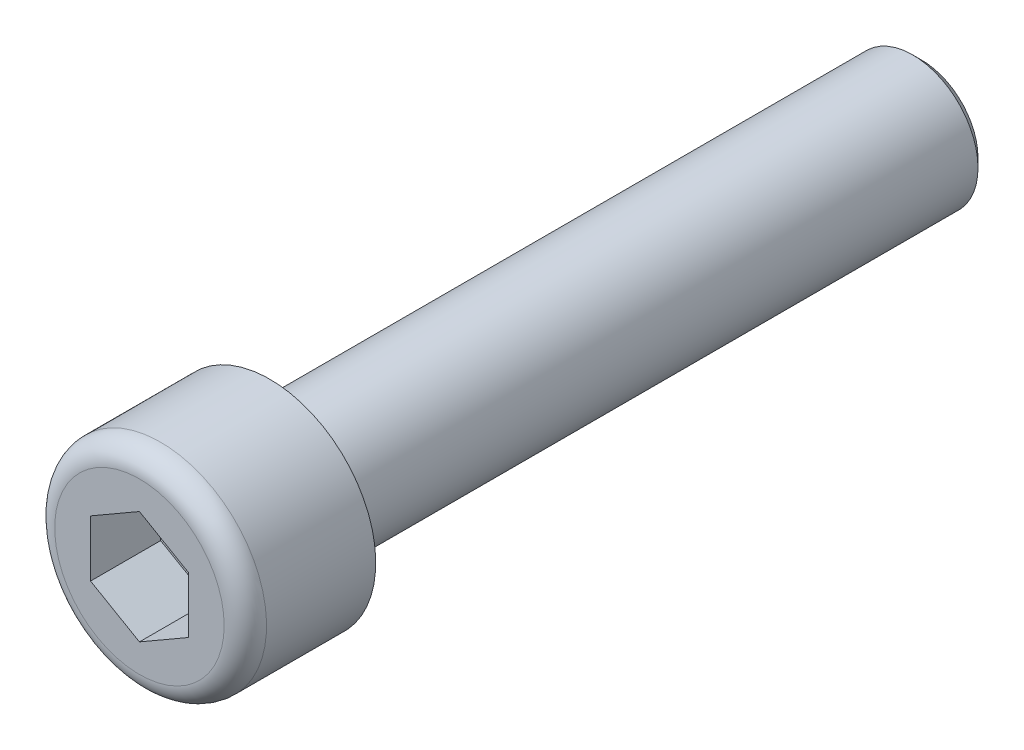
ISO-10303-21;
HEADER;
FILE_DESCRIPTION(('STEP AP214'),'2;1');
FILE_NAME('part.step','',(''),(''),'','','');
FILE_SCHEMA(('AUTOMOTIVE_DESIGN { 1 0 10303 214 1 1 1 1 }'));
ENDSEC;
DATA;
#1=APPLICATION_CONTEXT('core data for automotive mechanical design processes');
#2=APPLICATION_PROTOCOL_DEFINITION('international standard','automotive_design',2000,#1);
#3=PRODUCT_CONTEXT('',#1,'mechanical');
#4=PRODUCT('Part','Part','',(#3));
#5=PRODUCT_RELATED_PRODUCT_CATEGORY('part','',(#4));
#6=PRODUCT_DEFINITION_FORMATION('','',#4);
#7=PRODUCT_DEFINITION_CONTEXT('part definition',#1,'design');
#8=PRODUCT_DEFINITION('design','',#6,#7);
#9=PRODUCT_DEFINITION_SHAPE('','',#8);
#10=(LENGTH_UNIT() NAMED_UNIT(*) SI_UNIT(.MILLI.,.METRE.));
#11=(NAMED_UNIT(*) PLANE_ANGLE_UNIT() SI_UNIT($,.RADIAN.));
#12=(NAMED_UNIT(*) SI_UNIT($,.STERADIAN.) SOLID_ANGLE_UNIT());
#13=UNCERTAINTY_MEASURE_WITH_UNIT(LENGTH_MEASURE(1.E-05),#10,'distance_accuracy_value','');
#14=(GEOMETRIC_REPRESENTATION_CONTEXT(3) GLOBAL_UNCERTAINTY_ASSIGNED_CONTEXT((#13)) GLOBAL_UNIT_ASSIGNED_CONTEXT((#10,
#11,#12)) REPRESENTATION_CONTEXT('',''));
#15=CARTESIAN_POINT('',(0.,0.,0.));
#16=DIRECTION('',(0.,0.,1.));
#17=DIRECTION('',(1.,0.,0.));
#18=AXIS2_PLACEMENT_3D('',#15,#16,#17);
#19=CARTESIAN_POINT('',(0.,0.,0.));
#20=DIRECTION('',(0.,0.,1.));
#21=DIRECTION('',(-0.500000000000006,-0.866025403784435,0.));
#22=AXIS2_PLACEMENT_3D('',#19,#20,#21);
#23=PLANE('',#22);
#24=CARTESIAN_POINT('',(0.,0.,0.));
#25=DIRECTION('',(0.,0.,1.));
#26=DIRECTION('',(-0.500000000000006,-0.866025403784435,0.));
#27=AXIS2_PLACEMENT_3D('',#24,#25,#26);
#28=CIRCLE('',#27,6.5);
#29=CARTESIAN_POINT('',(-3.25000000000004,-5.62916512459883,0.));
#30=VERTEX_POINT('',#29);
#31=EDGE_CURVE('E107',#30,#30,#28,.T.);
#32=ORIENTED_EDGE('',*,*,#31,.F.);
#33=EDGE_LOOP('',(#32));
#34=FACE_BOUND('',#33,.T.);
#35=CARTESIAN_POINT('',(0.,0.,0.));
#36=DIRECTION('',(0.,0.,1.));
#37=DIRECTION('',(-0.500000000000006,-0.866025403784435,0.));
#38=AXIS2_PLACEMENT_3D('',#35,#36,#37);
#39=CIRCLE('',#38,4.);
#40=CARTESIAN_POINT('',(-2.00000000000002,-3.46410161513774,0.));
#41=VERTEX_POINT('',#40);
#42=EDGE_CURVE('E9',#41,#41,#39,.F.);
#43=ORIENTED_EDGE('',*,*,#42,.F.);
#44=EDGE_LOOP('',(#43));
#45=FACE_BOUND('',#44,.T.);
#46=ADVANCED_FACE('F14',(#34,#45),#23,.F.);
#47=CARTESIAN_POINT('',(4.50333209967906,-2.60000000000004,8.));
#48=DIRECTION('',(0.,0.,-1.));
#49=DIRECTION('',(0.500000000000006,0.866025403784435,0.));
#50=AXIS2_PLACEMENT_3D('',#47,#48,#49);
#51=PLANE('',#50);
#52=CARTESIAN_POINT('',(0.,0.,8.));
#53=DIRECTION('',(0.,0.,1.));
#54=DIRECTION('',(-0.500000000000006,-0.866025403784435,0.));
#55=AXIS2_PLACEMENT_3D('',#52,#53,#54);
#56=CIRCLE('',#55,5.2);
#57=CARTESIAN_POINT('',(-2.60000000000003,-4.50333209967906,8.));
#58=VERTEX_POINT('',#57);
#59=EDGE_CURVE('E89',#58,#58,#56,.T.);
#60=ORIENTED_EDGE('',*,*,#59,.T.);
#61=EDGE_LOOP('',(#60));
#62=FACE_BOUND('',#61,.T.);
#63=DIRECTION('',(0.866025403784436,-0.5,0.));
#64=VECTOR('',#63,1.);
#65=CARTESIAN_POINT('',(3.00333209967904,-5.19807621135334,8.));
#66=LINE('',#65,#64);
#67=CARTESIAN_POINT('',(-3.,-1.73205080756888,8.));
#68=VERTEX_POINT('',#67);
#69=CARTESIAN_POINT('',(0.,-3.46410161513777,8.));
#70=VERTEX_POINT('',#69);
#71=EDGE_CURVE('E23',#68,#70,#66,.T.);
#72=ORIENTED_EDGE('',*,*,#71,.F.);
#73=DIRECTION('',(0.,-1.,0.));
#74=VECTOR('',#73,1.);
#75=CARTESIAN_POINT('',(-3.,-2.6,8.));
#76=LINE('',#75,#74);
#77=CARTESIAN_POINT('',(-3.,1.73205080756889,8.));
#78=VERTEX_POINT('',#77);
#79=EDGE_CURVE('E38',#78,#68,#76,.T.);
#80=ORIENTED_EDGE('',*,*,#79,.F.);
#81=DIRECTION('',(-0.866025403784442,-0.5,0.));
#82=VECTOR('',#81,1.);
#83=CARTESIAN_POINT('',(0.751666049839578,3.89807621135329,8.));
#84=LINE('',#83,#82);
#85=CARTESIAN_POINT('',(0.,3.46410161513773,8.));
#86=VERTEX_POINT('',#85);
#87=EDGE_CURVE('E120',#86,#78,#84,.T.);
#88=ORIENTED_EDGE('',*,*,#87,.F.);
#89=DIRECTION('',(-0.866025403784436,0.5,0.));
#90=VECTOR('',#89,1.);
#91=CARTESIAN_POINT('',(6.00333209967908,-0.00192378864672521,8.));
#92=LINE('',#91,#90);
#93=CARTESIAN_POINT('',(3.,1.73205080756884,8.));
#94=VERTEX_POINT('',#93);
#95=EDGE_CURVE('E117',#94,#86,#92,.T.);
#96=ORIENTED_EDGE('',*,*,#95,.F.);
#97=DIRECTION('',(0.,1.,0.));
#98=VECTOR('',#97,1.);
#99=CARTESIAN_POINT('',(3.,-2.60000000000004,8.));
#100=LINE('',#99,#98);
#101=CARTESIAN_POINT('',(3.,-1.7320508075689,8.));
#102=VERTEX_POINT('',#101);
#103=EDGE_CURVE('E114',#102,#94,#100,.T.);
#104=ORIENTED_EDGE('',*,*,#103,.F.);
#105=DIRECTION('',(0.866025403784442,0.5,0.));
#106=VECTOR('',#105,1.);
#107=CARTESIAN_POINT('',(3.75166604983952,-1.29807621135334,8.));
#108=LINE('',#107,#106);
#109=EDGE_CURVE('E111',#70,#102,#108,.T.);
#110=ORIENTED_EDGE('',*,*,#109,.F.);
#111=EDGE_LOOP('',(#72,#80,#88,#96,#104,#110));
#112=FACE_BOUND('',#111,.T.);
#113=ADVANCED_FACE('F16',(#62,#112),#51,.F.);
#114=CARTESIAN_POINT('',(0.,0.,8.));
#115=DIRECTION('',(0.,0.,1.));
#116=DIRECTION('',(-0.500000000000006,-0.866025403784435,0.));
#117=AXIS2_PLACEMENT_3D('',#114,#115,#116);
#118=CYLINDRICAL_SURFACE('',#117,6.5);
#119=CARTESIAN_POINT('',(0.,0.,6.7));
#120=DIRECTION('',(0.,0.,1.));
#121=DIRECTION('',(-0.500000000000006,-0.866025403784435,0.));
#122=AXIS2_PLACEMENT_3D('',#119,#120,#121);
#123=CIRCLE('',#122,6.5);
#124=CARTESIAN_POINT('',(-3.25000000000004,-5.62916512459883,6.7));
#125=VERTEX_POINT('',#124);
#126=EDGE_CURVE('E97',#125,#125,#123,.T.);
#127=ORIENTED_EDGE('',*,*,#126,.F.);
#128=EDGE_LOOP('',(#127));
#129=FACE_BOUND('',#128,.T.);
#130=ORIENTED_EDGE('',*,*,#31,.T.);
#131=EDGE_LOOP('',(#130));
#132=FACE_BOUND('',#131,.T.);
#133=ADVANCED_FACE('F206',(#129,#132),#118,.T.);
#134=CARTESIAN_POINT('',(0.,0.,6.7));
#135=DIRECTION('',(0.,0.,1.));
#136=DIRECTION('',(-0.500000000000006,-0.866025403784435,0.));
#137=AXIS2_PLACEMENT_3D('',#134,#135,#136);
#138=TOROIDAL_SURFACE('',#137,5.2,1.3);
#139=ORIENTED_EDGE('',*,*,#59,.F.);
#140=EDGE_LOOP('',(#139));
#141=FACE_BOUND('',#140,.T.);
#142=ORIENTED_EDGE('',*,*,#126,.T.);
#143=EDGE_LOOP('',(#142));
#144=FACE_BOUND('',#143,.T.);
#145=ADVANCED_FACE('F213',(#141,#144),#138,.T.);
#146=CARTESIAN_POINT('',(0.,-3.46410161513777,3.7));
#147=DIRECTION('',(0.5,0.866025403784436,0.));
#148=DIRECTION('',(0.866025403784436,-0.5,0.));
#149=AXIS2_PLACEMENT_3D('',#146,#147,#148);
#150=PLANE('',#149);
#151=ORIENTED_EDGE('',*,*,#71,.T.);
#152=DIRECTION('',(0.,0.,1.));
#153=VECTOR('',#152,1.);
#154=CARTESIAN_POINT('',(0.,-3.46410161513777,3.7));
#155=LINE('',#154,#153);
#156=CARTESIAN_POINT('',(0.,-3.46410161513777,3.7));
#157=VERTEX_POINT('',#156);
#158=EDGE_CURVE('E30',#157,#70,#155,.T.);
#159=ORIENTED_EDGE('',*,*,#158,.F.);
#160=DIRECTION('',(-0.866025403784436,0.5,0.));
#161=VECTOR('',#160,1.);
#162=CARTESIAN_POINT('',(0.,-3.46410161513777,3.7));
#163=LINE('',#162,#161);
#164=CARTESIAN_POINT('',(-3.,-1.73205080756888,3.7));
#165=VERTEX_POINT('',#164);
#166=EDGE_CURVE('E74',#157,#165,#163,.T.);
#167=ORIENTED_EDGE('',*,*,#166,.T.);
#168=DIRECTION('',(0.,0.,1.));
#169=VECTOR('',#168,1.);
#170=CARTESIAN_POINT('',(-3.,-1.73205080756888,3.7));
#171=LINE('',#170,#169);
#172=EDGE_CURVE('E82',#165,#68,#171,.T.);
#173=ORIENTED_EDGE('',*,*,#172,.T.);
#174=EDGE_LOOP('',(#151,#159,#167,#173));
#175=FACE_BOUND('',#174,.T.);
#176=ADVANCED_FACE('F81',(#175),#150,.T.);
#177=CARTESIAN_POINT('',(-3.,-1.73205080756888,3.7));
#178=DIRECTION('',(1.,0.,0.));
#179=DIRECTION('',(0.,-1.,0.));
#180=AXIS2_PLACEMENT_3D('',#177,#178,#179);
#181=PLANE('',#180);
#182=ORIENTED_EDGE('',*,*,#79,.T.);
#183=ORIENTED_EDGE('',*,*,#172,.F.);
#184=DIRECTION('',(0.,1.,0.));
#185=VECTOR('',#184,1.);
#186=CARTESIAN_POINT('',(-3.,-1.73205080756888,3.7));
#187=LINE('',#186,#185);
#188=CARTESIAN_POINT('',(-3.,1.73205080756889,3.7));
#189=VERTEX_POINT('',#188);
#190=EDGE_CURVE('E70',#165,#189,#187,.T.);
#191=ORIENTED_EDGE('',*,*,#190,.T.);
#192=DIRECTION('',(0.,0.,1.));
#193=VECTOR('',#192,1.);
#194=CARTESIAN_POINT('',(-3.,1.73205080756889,3.7));
#195=LINE('',#194,#193);
#196=EDGE_CURVE('E90',#189,#78,#195,.T.);
#197=ORIENTED_EDGE('',*,*,#196,.T.);
#198=EDGE_LOOP('',(#182,#183,#191,#197));
#199=FACE_BOUND('',#198,.T.);
#200=ADVANCED_FACE('F87',(#199),#181,.T.);
#201=CARTESIAN_POINT('',(-3.,1.73205080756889,3.7));
#202=DIRECTION('',(0.5,-0.866025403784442,0.));
#203=DIRECTION('',(-0.866025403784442,-0.5,0.));
#204=AXIS2_PLACEMENT_3D('',#201,#202,#203);
#205=PLANE('',#204);
#206=ORIENTED_EDGE('',*,*,#87,.T.);
#207=ORIENTED_EDGE('',*,*,#196,.F.);
#208=DIRECTION('',(0.866025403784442,0.5,0.));
#209=VECTOR('',#208,1.);
#210=CARTESIAN_POINT('',(-3.,1.73205080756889,3.7));
#211=LINE('',#210,#209);
#212=CARTESIAN_POINT('',(0.,3.46410161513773,3.7));
#213=VERTEX_POINT('',#212);
#214=EDGE_CURVE('E76',#189,#213,#211,.T.);
#215=ORIENTED_EDGE('',*,*,#214,.T.);
#216=DIRECTION('',(0.,0.,1.));
#217=VECTOR('',#216,1.);
#218=CARTESIAN_POINT('',(0.,3.46410161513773,3.7));
#219=LINE('',#218,#217);
#220=EDGE_CURVE('E100',#213,#86,#219,.T.);
#221=ORIENTED_EDGE('',*,*,#220,.T.);
#222=EDGE_LOOP('',(#206,#207,#215,#221));
#223=FACE_BOUND('',#222,.T.);
#224=ADVANCED_FACE('F159',(#223),#205,.T.);
#225=CARTESIAN_POINT('',(0.,3.46410161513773,3.7));
#226=DIRECTION('',(-0.5,-0.866025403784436,0.));
#227=DIRECTION('',(-0.866025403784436,0.5,0.));
#228=AXIS2_PLACEMENT_3D('',#225,#226,#227);
#229=PLANE('',#228);
#230=ORIENTED_EDGE('',*,*,#95,.T.);
#231=ORIENTED_EDGE('',*,*,#220,.F.);
#232=DIRECTION('',(0.866025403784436,-0.5,0.));
#233=VECTOR('',#232,1.);
#234=CARTESIAN_POINT('',(0.,3.46410161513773,3.7));
#235=LINE('',#234,#233);
#236=CARTESIAN_POINT('',(3.,1.73205080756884,3.7));
#237=VERTEX_POINT('',#236);
#238=EDGE_CURVE('E162',#213,#237,#235,.T.);
#239=ORIENTED_EDGE('',*,*,#238,.T.);
#240=DIRECTION('',(0.,0.,1.));
#241=VECTOR('',#240,1.);
#242=CARTESIAN_POINT('',(3.,1.73205080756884,3.7));
#243=LINE('',#242,#241);
#244=EDGE_CURVE('E141',#237,#94,#243,.T.);
#245=ORIENTED_EDGE('',*,*,#244,.T.);
#246=EDGE_LOOP('',(#230,#231,#239,#245));
#247=FACE_BOUND('',#246,.T.);
#248=ADVANCED_FACE('F161',(#247),#229,.T.);
#249=CARTESIAN_POINT('',(3.,1.73205080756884,3.7));
#250=DIRECTION('',(-1.,0.,0.));
#251=DIRECTION('',(0.,1.,0.));
#252=AXIS2_PLACEMENT_3D('',#249,#250,#251);
#253=PLANE('',#252);
#254=ORIENTED_EDGE('',*,*,#103,.T.);
#255=ORIENTED_EDGE('',*,*,#244,.F.);
#256=DIRECTION('',(0.,-1.,0.));
#257=VECTOR('',#256,1.);
#258=CARTESIAN_POINT('',(3.,1.73205080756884,3.7));
#259=LINE('',#258,#257);
#260=CARTESIAN_POINT('',(3.,-1.7320508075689,3.7));
#261=VERTEX_POINT('',#260);
#262=EDGE_CURVE('E139',#237,#261,#259,.T.);
#263=ORIENTED_EDGE('',*,*,#262,.T.);
#264=DIRECTION('',(0.,0.,1.));
#265=VECTOR('',#264,1.);
#266=CARTESIAN_POINT('',(3.,-1.7320508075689,3.7));
#267=LINE('',#266,#265);
#268=EDGE_CURVE('E133',#261,#102,#267,.T.);
#269=ORIENTED_EDGE('',*,*,#268,.T.);
#270=EDGE_LOOP('',(#254,#255,#263,#269));
#271=FACE_BOUND('',#270,.T.);
#272=ADVANCED_FACE('F135',(#271),#253,.T.);
#273=CARTESIAN_POINT('',(3.,-1.7320508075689,3.7));
#274=DIRECTION('',(-0.5,0.866025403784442,0.));
#275=DIRECTION('',(0.866025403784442,0.5,0.));
#276=AXIS2_PLACEMENT_3D('',#273,#274,#275);
#277=PLANE('',#276);
#278=ORIENTED_EDGE('',*,*,#109,.T.);
#279=ORIENTED_EDGE('',*,*,#268,.F.);
#280=DIRECTION('',(-0.866025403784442,-0.5,0.));
#281=VECTOR('',#280,1.);
#282=CARTESIAN_POINT('',(3.,-1.7320508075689,3.7));
#283=LINE('',#282,#281);
#284=EDGE_CURVE('E149',#261,#157,#283,.T.);
#285=ORIENTED_EDGE('',*,*,#284,.T.);
#286=ORIENTED_EDGE('',*,*,#158,.T.);
#287=EDGE_LOOP('',(#278,#279,#285,#286));
#288=FACE_BOUND('',#287,.T.);
#289=ADVANCED_FACE('F132',(#288),#277,.T.);
#290=CARTESIAN_POINT('',(0.,-3.46410161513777,3.7));
#291=DIRECTION('',(0.,0.,1.));
#292=DIRECTION('',(0.500000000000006,0.866025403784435,0.));
#293=AXIS2_PLACEMENT_3D('',#290,#291,#292);
#294=PLANE('',#293);
#295=ORIENTED_EDGE('',*,*,#166,.F.);
#296=ORIENTED_EDGE('',*,*,#284,.F.);
#297=ORIENTED_EDGE('',*,*,#262,.F.);
#298=ORIENTED_EDGE('',*,*,#238,.F.);
#299=ORIENTED_EDGE('',*,*,#214,.F.);
#300=ORIENTED_EDGE('',*,*,#190,.F.);
#301=EDGE_LOOP('',(#295,#296,#297,#298,#299,#300));
#302=FACE_BOUND('',#301,.T.);
#303=ADVANCED_FACE('F72',(#302),#294,.T.);
#304=CARTESIAN_POINT('',(0.,0.,-40.));
#305=DIRECTION('',(0.,0.,1.));
#306=DIRECTION('',(-0.500000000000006,-0.866025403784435,0.));
#307=AXIS2_PLACEMENT_3D('',#304,#305,#306);
#308=PLANE('',#307);
#309=CARTESIAN_POINT('',(0.,0.,-40.));
#310=DIRECTION('',(0.,0.,1.));
#311=DIRECTION('',(-0.500000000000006,-0.866025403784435,0.));
#312=AXIS2_PLACEMENT_3D('',#309,#310,#311);
#313=CIRCLE('',#312,3.45875);
#314=CARTESIAN_POINT('',(-1.72937500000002,-2.99536536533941,-40.));
#315=VERTEX_POINT('',#314);
#316=EDGE_CURVE('E85',#315,#315,#313,.T.);
#317=ORIENTED_EDGE('',*,*,#316,.F.);
#318=EDGE_LOOP('',(#317));
#319=FACE_BOUND('',#318,.T.);
#320=ADVANCED_FACE('F188',(#319),#308,.F.);
#321=CARTESIAN_POINT('',(0.,0.,-40.));
#322=DIRECTION('',(0.,0.,1.));
#323=DIRECTION('',(-0.500000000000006,-0.866025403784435,0.));
#324=AXIS2_PLACEMENT_3D('',#321,#322,#323);
#325=CONICAL_SURFACE('',#324,3.45875,0.785398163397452);
#326=CARTESIAN_POINT('',(0.,0.,-39.45875));
#327=DIRECTION('',(0.,0.,1.));
#328=DIRECTION('',(-0.500000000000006,-0.866025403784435,0.));
#329=AXIS2_PLACEMENT_3D('',#326,#327,#328);
#330=CIRCLE('',#329,4.);
#331=CARTESIAN_POINT('',(-2.00000000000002,-3.46410161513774,-39.45875));
#332=VERTEX_POINT('',#331);
#333=EDGE_CURVE('E175',#332,#332,#330,.T.);
#334=ORIENTED_EDGE('',*,*,#333,.F.);
#335=EDGE_LOOP('',(#334));
#336=FACE_BOUND('',#335,.T.);
#337=ORIENTED_EDGE('',*,*,#316,.T.);
#338=EDGE_LOOP('',(#337));
#339=FACE_BOUND('',#338,.T.);
#340=ADVANCED_FACE('F185',(#336,#339),#325,.T.);
#341=CARTESIAN_POINT('',(0.,0.,0.));
#342=DIRECTION('',(0.,0.,1.));
#343=DIRECTION('',(-0.500000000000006,-0.866025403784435,0.));
#344=AXIS2_PLACEMENT_3D('',#341,#342,#343);
#345=CYLINDRICAL_SURFACE('',#344,4.);
#346=ORIENTED_EDGE('',*,*,#42,.T.);
#347=EDGE_LOOP('',(#346));
#348=FACE_BOUND('',#347,.T.);
#349=ORIENTED_EDGE('',*,*,#333,.T.);
#350=EDGE_LOOP('',(#349));
#351=FACE_BOUND('',#350,.T.);
#352=ADVANCED_FACE('F183',(#348,#351),#345,.T.);
#353=CLOSED_SHELL('',(#46,#113,#133,#145,#176,#200,#224,#248,#272,#289,#303,#320,#340,#352));
#354=MANIFOLD_SOLID_BREP('B1',#353);
#355=ADVANCED_BREP_SHAPE_REPRESENTATION('',(#18,#354),#14);
#356=SHAPE_DEFINITION_REPRESENTATION(#9,#355);
ENDSEC;
END-ISO-10303-21;
